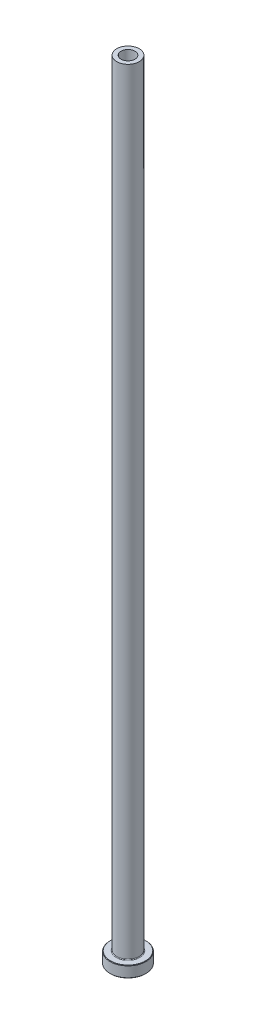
ISO-10303-21;
HEADER;
FILE_DESCRIPTION(('STEP AP214'),'2;1');
FILE_NAME('part.step','',(''),(''),'','','');
FILE_SCHEMA(('AUTOMOTIVE_DESIGN { 1 0 10303 214 1 1 1 1 }'));
ENDSEC;
DATA;
#1=APPLICATION_CONTEXT('core data for automotive mechanical design processes');
#2=APPLICATION_PROTOCOL_DEFINITION('international standard','automotive_design',2000,#1);
#3=PRODUCT_CONTEXT('',#1,'mechanical');
#4=PRODUCT('Part','Part','',(#3));
#5=PRODUCT_RELATED_PRODUCT_CATEGORY('part','',(#4));
#6=PRODUCT_DEFINITION_FORMATION('','',#4);
#7=PRODUCT_DEFINITION_CONTEXT('part definition',#1,'design');
#8=PRODUCT_DEFINITION('design','',#6,#7);
#9=PRODUCT_DEFINITION_SHAPE('','',#8);
#10=(LENGTH_UNIT() NAMED_UNIT(*) SI_UNIT(.MILLI.,.METRE.));
#11=(NAMED_UNIT(*) PLANE_ANGLE_UNIT() SI_UNIT($,.RADIAN.));
#12=(NAMED_UNIT(*) SI_UNIT($,.STERADIAN.) SOLID_ANGLE_UNIT());
#13=UNCERTAINTY_MEASURE_WITH_UNIT(LENGTH_MEASURE(1.E-05),#10,'distance_accuracy_value','');
#14=(GEOMETRIC_REPRESENTATION_CONTEXT(3) GLOBAL_UNCERTAINTY_ASSIGNED_CONTEXT((#13)) GLOBAL_UNIT_ASSIGNED_CONTEXT((#10,
#11,#12)) REPRESENTATION_CONTEXT('',''));
#15=CARTESIAN_POINT('',(0.,0.,0.));
#16=DIRECTION('',(0.,0.,1.));
#17=DIRECTION('',(1.,0.,0.));
#18=AXIS2_PLACEMENT_3D('',#15,#16,#17);
#19=CARTESIAN_POINT('',(0.,92.1876809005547,0.));
#20=DIRECTION('',(0.,1.,0.));
#21=DIRECTION('',(0.,0.,1.));
#22=AXIS2_PLACEMENT_3D('',#19,#20,#21);
#23=CYLINDRICAL_SURFACE('',#22,3.10000000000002);
#24=CARTESIAN_POINT('',(0.,350.,0.));
#25=DIRECTION('',(0.,1.,0.));
#26=DIRECTION('',(0.,0.,1.));
#27=AXIS2_PLACEMENT_3D('',#24,#25,#26);
#28=CIRCLE('',#27,3.10000000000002);
#29=CARTESIAN_POINT('',(0.,350.,3.10000000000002));
#30=VERTEX_POINT('',#29);
#31=EDGE_CURVE('E62',#30,#30,#28,.T.);
#32=ORIENTED_EDGE('',*,*,#31,.T.);
#33=EDGE_LOOP('',(#32));
#34=FACE_BOUND('',#33,.T.);
#35=CARTESIAN_POINT('',(0.,305.,0.));
#36=DIRECTION('',(0.,1.,0.));
#37=DIRECTION('',(0.,0.,1.));
#38=AXIS2_PLACEMENT_3D('',#35,#36,#37);
#39=CIRCLE('',#38,3.10000000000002);
#40=CARTESIAN_POINT('',(0.,305.,3.10000000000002));
#41=VERTEX_POINT('',#40);
#42=EDGE_CURVE('E71',#41,#41,#39,.T.);
#43=ORIENTED_EDGE('',*,*,#42,.F.);
#44=EDGE_LOOP('',(#43));
#45=FACE_BOUND('',#44,.T.);
#46=ADVANCED_FACE('F30',(#34,#45),#23,.F.);
#47=CARTESIAN_POINT('',(-3.10000000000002,350.,0.));
#48=DIRECTION('',(0.,1.,0.));
#49=DIRECTION('',(0.,0.,1.));
#50=AXIS2_PLACEMENT_3D('',#47,#48,#49);
#51=PLANE('',#50);
#52=CARTESIAN_POINT('',(0.,350.,0.));
#53=DIRECTION('',(0.,1.,0.));
#54=DIRECTION('',(0.,0.,1.));
#55=AXIS2_PLACEMENT_3D('',#52,#53,#54);
#56=CIRCLE('',#55,5.00000000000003);
#57=CARTESIAN_POINT('',(0.,350.,5.00000000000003));
#58=VERTEX_POINT('',#57);
#59=EDGE_CURVE('E65',#58,#58,#56,.T.);
#60=ORIENTED_EDGE('',*,*,#59,.T.);
#61=EDGE_LOOP('',(#60));
#62=FACE_BOUND('',#61,.T.);
#63=ORIENTED_EDGE('',*,*,#31,.F.);
#64=EDGE_LOOP('',(#63));
#65=FACE_BOUND('',#64,.T.);
#66=ADVANCED_FACE('F79',(#62,#65),#51,.T.);
#67=CARTESIAN_POINT('',(0.,92.1876809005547,0.));
#68=DIRECTION('',(0.,1.,0.));
#69=DIRECTION('',(0.,0.,1.));
#70=AXIS2_PLACEMENT_3D('',#67,#68,#69);
#71=CYLINDRICAL_SURFACE('',#70,5.00000000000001);
#72=CARTESIAN_POINT('',(0.,5.3,0.));
#73=DIRECTION('',(0.,1.,0.));
#74=DIRECTION('',(0.,0.,1.));
#75=AXIS2_PLACEMENT_3D('',#72,#73,#74);
#76=CIRCLE('',#75,5.00000000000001);
#77=CARTESIAN_POINT('',(0.,5.3,5.00000000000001));
#78=VERTEX_POINT('',#77);
#79=EDGE_CURVE('E59',#78,#78,#76,.T.);
#80=ORIENTED_EDGE('',*,*,#79,.T.);
#81=EDGE_LOOP('',(#80));
#82=FACE_BOUND('',#81,.T.);
#83=ORIENTED_EDGE('',*,*,#59,.F.);
#84=EDGE_LOOP('',(#83));
#85=FACE_BOUND('',#84,.T.);
#86=ADVANCED_FACE('F85',(#82,#85),#71,.T.);
#87=CARTESIAN_POINT('',(-4.99999999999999,5.,0.));
#88=DIRECTION('',(0.,1.,0.));
#89=DIRECTION('',(0.,0.,1.));
#90=AXIS2_PLACEMENT_3D('',#87,#88,#89);
#91=PLANE('',#90);
#92=CARTESIAN_POINT('',(0.,5.,0.));
#93=DIRECTION('',(0.,1.,0.));
#94=DIRECTION('',(0.,0.,1.));
#95=AXIS2_PLACEMENT_3D('',#92,#93,#94);
#96=CIRCLE('',#95,7.80000000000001);
#97=CARTESIAN_POINT('',(0.,5.,7.80000000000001));
#98=VERTEX_POINT('',#97);
#99=EDGE_CURVE('E53',#98,#98,#96,.T.);
#100=ORIENTED_EDGE('',*,*,#99,.T.);
#101=EDGE_LOOP('',(#100));
#102=FACE_BOUND('',#101,.T.);
#103=CARTESIAN_POINT('',(0.,5.,0.));
#104=DIRECTION('',(0.,1.,0.));
#105=DIRECTION('',(0.,0.,1.));
#106=AXIS2_PLACEMENT_3D('',#103,#104,#105);
#107=CIRCLE('',#106,5.30000000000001);
#108=CARTESIAN_POINT('',(0.,5.,5.30000000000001));
#109=VERTEX_POINT('',#108);
#110=EDGE_CURVE('E56',#109,#109,#107,.F.);
#111=ORIENTED_EDGE('',*,*,#110,.T.);
#112=EDGE_LOOP('',(#111));
#113=FACE_BOUND('',#112,.T.);
#114=ADVANCED_FACE('F111',(#102,#113),#91,.T.);
#115=CARTESIAN_POINT('',(0.,92.1876809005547,0.));
#116=DIRECTION('',(0.,1.,0.));
#117=DIRECTION('',(0.,0.,1.));
#118=AXIS2_PLACEMENT_3D('',#115,#116,#117);
#119=CYLINDRICAL_SURFACE('',#118,7.99999999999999);
#120=CARTESIAN_POINT('',(0.,4.80000000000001,0.));
#121=DIRECTION('',(0.,1.,0.));
#122=DIRECTION('',(0.,0.,1.));
#123=AXIS2_PLACEMENT_3D('',#120,#121,#122);
#124=CIRCLE('',#123,7.99999999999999);
#125=CARTESIAN_POINT('',(0.,4.80000000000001,7.99999999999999));
#126=VERTEX_POINT('',#125);
#127=EDGE_CURVE('E45',#126,#126,#124,.F.);
#128=ORIENTED_EDGE('',*,*,#127,.T.);
#129=EDGE_LOOP('',(#128));
#130=FACE_BOUND('',#129,.T.);
#131=CARTESIAN_POINT('',(0.,0.20000000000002,0.));
#132=DIRECTION('',(0.,-1.,0.));
#133=DIRECTION('',(0.,0.,-1.));
#134=AXIS2_PLACEMENT_3D('',#131,#132,#133);
#135=CIRCLE('',#134,7.99999999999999);
#136=CARTESIAN_POINT('',(0.,0.20000000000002,-7.99999999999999));
#137=VERTEX_POINT('',#136);
#138=EDGE_CURVE('E50',#137,#137,#135,.F.);
#139=ORIENTED_EDGE('',*,*,#138,.T.);
#140=EDGE_LOOP('',(#139));
#141=FACE_BOUND('',#140,.T.);
#142=ADVANCED_FACE('F108',(#130,#141),#119,.T.);
#143=CARTESIAN_POINT('',(-7.99999999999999,0.,0.));
#144=DIRECTION('',(0.,-1.,0.));
#145=DIRECTION('',(0.,0.,-1.));
#146=AXIS2_PLACEMENT_3D('',#143,#144,#145);
#147=PLANE('',#146);
#148=CARTESIAN_POINT('',(0.,0.,0.));
#149=DIRECTION('',(0.,-1.,0.));
#150=DIRECTION('',(0.,0.,-1.));
#151=AXIS2_PLACEMENT_3D('',#148,#149,#150);
#152=CIRCLE('',#151,3.85000000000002);
#153=CARTESIAN_POINT('',(0.,0.,-3.85000000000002));
#154=VERTEX_POINT('',#153);
#155=EDGE_CURVE('E37',#154,#154,#152,.F.);
#156=ORIENTED_EDGE('',*,*,#155,.T.);
#157=EDGE_LOOP('',(#156));
#158=FACE_BOUND('',#157,.T.);
#159=CARTESIAN_POINT('',(0.,0.,0.));
#160=DIRECTION('',(0.,-1.,0.));
#161=DIRECTION('',(0.,0.,-1.));
#162=AXIS2_PLACEMENT_3D('',#159,#160,#161);
#163=CIRCLE('',#162,7.79999999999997);
#164=CARTESIAN_POINT('',(0.,0.,-7.79999999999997));
#165=VERTEX_POINT('',#164);
#166=EDGE_CURVE('E41',#165,#165,#163,.T.);
#167=ORIENTED_EDGE('',*,*,#166,.T.);
#168=EDGE_LOOP('',(#167));
#169=FACE_BOUND('',#168,.T.);
#170=ADVANCED_FACE('F110',(#158,#169),#147,.T.);
#171=CARTESIAN_POINT('',(0.,92.1876809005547,0.));
#172=DIRECTION('',(0.,1.,0.));
#173=DIRECTION('',(0.,0.,1.));
#174=AXIS2_PLACEMENT_3D('',#171,#172,#173);
#175=CYLINDRICAL_SURFACE('',#174,3.35000000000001);
#176=CARTESIAN_POINT('',(0.,0.499999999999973,0.));
#177=DIRECTION('',(0.,-1.,0.));
#178=DIRECTION('',(0.,0.,-1.));
#179=AXIS2_PLACEMENT_3D('',#176,#177,#178);
#180=CIRCLE('',#179,3.35000000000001);
#181=CARTESIAN_POINT('',(0.,0.499999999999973,-3.35000000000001));
#182=VERTEX_POINT('',#181);
#183=EDGE_CURVE('E10',#182,#182,#180,.T.);
#184=ORIENTED_EDGE('',*,*,#183,.T.);
#185=EDGE_LOOP('',(#184));
#186=FACE_BOUND('',#185,.T.);
#187=CARTESIAN_POINT('',(0.,293.,0.));
#188=DIRECTION('',(0.,1.,0.));
#189=DIRECTION('',(0.,0.,1.));
#190=AXIS2_PLACEMENT_3D('',#187,#188,#189);
#191=CIRCLE('',#190,3.35000000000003);
#192=CARTESIAN_POINT('',(0.,293.,3.35000000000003));
#193=VERTEX_POINT('',#192);
#194=EDGE_CURVE('E68',#193,#193,#191,.T.);
#195=ORIENTED_EDGE('',*,*,#194,.T.);
#196=EDGE_LOOP('',(#195));
#197=FACE_BOUND('',#196,.T.);
#198=ADVANCED_FACE('F118',(#186,#197),#175,.F.);
#199=CARTESIAN_POINT('',(0.,293.,0.));
#200=DIRECTION('',(0.,-1.,0.));
#201=DIRECTION('',(0.,0.,-1.));
#202=AXIS2_PLACEMENT_3D('',#199,#200,#201);
#203=CONICAL_SURFACE('',#202,3.35000000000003,0.0208303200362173);
#204=ORIENTED_EDGE('',*,*,#42,.T.);
#205=EDGE_LOOP('',(#204));
#206=FACE_BOUND('',#205,.T.);
#207=ORIENTED_EDGE('',*,*,#194,.F.);
#208=EDGE_LOOP('',(#207));
#209=FACE_BOUND('',#208,.T.);
#210=ADVANCED_FACE('F75',(#206,#209),#203,.F.);
#211=CARTESIAN_POINT('',(0.,5.3,0.));
#212=DIRECTION('',(0.,1.,0.));
#213=DIRECTION('',(0.,0.,1.));
#214=AXIS2_PLACEMENT_3D('',#211,#212,#213);
#215=TOROIDAL_SURFACE('',#214,5.30000000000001,0.3);
#216=ORIENTED_EDGE('',*,*,#110,.F.);
#217=EDGE_LOOP('',(#216));
#218=FACE_BOUND('',#217,.T.);
#219=ORIENTED_EDGE('',*,*,#79,.F.);
#220=EDGE_LOOP('',(#219));
#221=FACE_BOUND('',#220,.T.);
#222=ADVANCED_FACE('F90',(#218,#221),#215,.F.);
#223=CARTESIAN_POINT('',(0.,5.,0.));
#224=DIRECTION('',(0.,-1.,0.));
#225=DIRECTION('',(0.,0.,-1.));
#226=AXIS2_PLACEMENT_3D('',#223,#224,#225);
#227=CONICAL_SURFACE('',#226,7.8,0.78539816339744);
#228=ORIENTED_EDGE('',*,*,#127,.F.);
#229=EDGE_LOOP('',(#228));
#230=FACE_BOUND('',#229,.T.);
#231=ORIENTED_EDGE('',*,*,#99,.F.);
#232=EDGE_LOOP('',(#231));
#233=FACE_BOUND('',#232,.T.);
#234=ADVANCED_FACE('F93',(#230,#233),#227,.T.);
#235=CARTESIAN_POINT('',(0.,0.20000000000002,0.));
#236=DIRECTION('',(0.,1.,0.));
#237=DIRECTION('',(0.,0.,1.));
#238=AXIS2_PLACEMENT_3D('',#235,#236,#237);
#239=CONICAL_SURFACE('',#238,7.99999999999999,0.78539816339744);
#240=ORIENTED_EDGE('',*,*,#166,.F.);
#241=EDGE_LOOP('',(#240));
#242=FACE_BOUND('',#241,.T.);
#243=ORIENTED_EDGE('',*,*,#138,.F.);
#244=EDGE_LOOP('',(#243));
#245=FACE_BOUND('',#244,.T.);
#246=ADVANCED_FACE('F96',(#242,#245),#239,.T.);
#247=CARTESIAN_POINT('',(0.,0.,0.));
#248=DIRECTION('',(0.,-1.,0.));
#249=DIRECTION('',(0.,0.,-1.));
#250=AXIS2_PLACEMENT_3D('',#247,#248,#249);
#251=CONICAL_SURFACE('',#250,3.85000000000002,0.785398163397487);
#252=ORIENTED_EDGE('',*,*,#183,.F.);
#253=EDGE_LOOP('',(#252));
#254=FACE_BOUND('',#253,.T.);
#255=ORIENTED_EDGE('',*,*,#155,.F.);
#256=EDGE_LOOP('',(#255));
#257=FACE_BOUND('',#256,.T.);
#258=ADVANCED_FACE('F32',(#254,#257),#251,.F.);
#259=CLOSED_SHELL('',(#46,#66,#86,#114,#142,#170,#198,#210,#222,#234,#246,#258));
#260=MANIFOLD_SOLID_BREP('B2',#259);
#261=ADVANCED_BREP_SHAPE_REPRESENTATION('',(#18,#260),#14);
#262=SHAPE_DEFINITION_REPRESENTATION(#9,#261);
ENDSEC;
END-ISO-10303-21;
